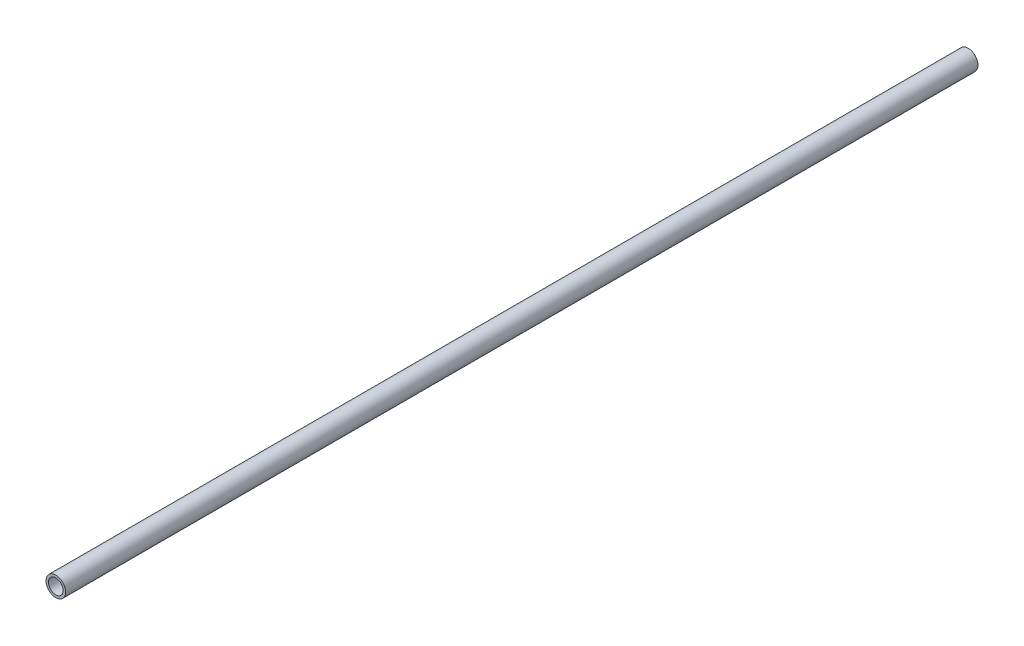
from build123d import *

# Parameters (mm, degrees)
SKETCH1_R               = 6.35
BOSS_EXTRUDE1_DEPTH     = 590.55
CUT_EXTRUDE1_DEPTH      = 591.618275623
CUT_EXTRUDE1_DEPTH_BACK = 591.618275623
SKETCH2_R               = 4.7625


with BuildPart() as part:
    # Sketch1 → Boss-Extrude1 (new body)
    with BuildSketch(Plane.XY):
        Circle(SKETCH1_R)
    extrude(amount=BOSS_EXTRUDE1_DEPTH)

    # Sketch2 → Cut-Extrude1 (cut, two sides: drawn at the far end of the back side and taken through both)
    with BuildSketch(Plane.XY.offset(590.55).offset(-CUT_EXTRUDE1_DEPTH_BACK)):
        Circle(SKETCH2_R)
    extrude(amount=CUT_EXTRUDE1_DEPTH + CUT_EXTRUDE1_DEPTH_BACK, mode=Mode.SUBTRACT)


solid = part.part
